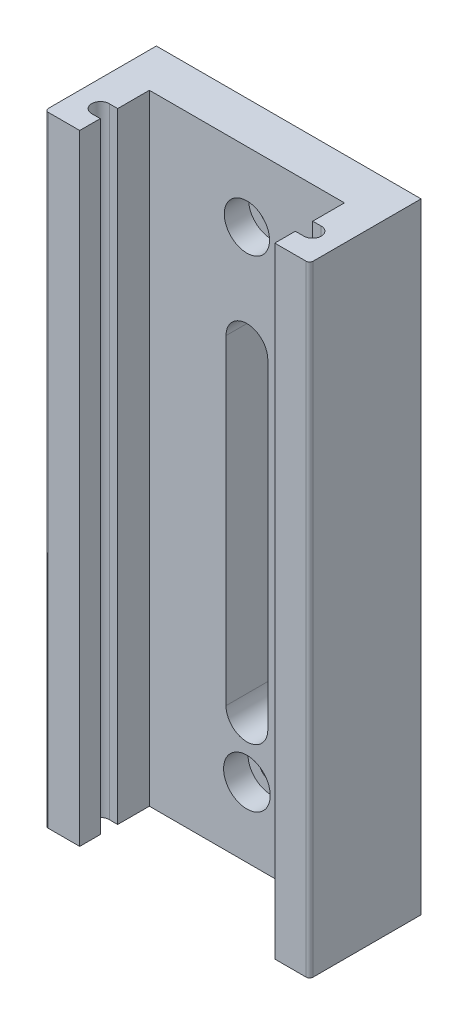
from build123d import *

# Parameters (mm, degrees)
EXTRUSION1_DEPTH        = 89
ESQUISSE2_R             = 3.25
ESQUISSE2_R_2           = 3.35
ENL_V_MAT_EXTRU_1_DEPTH = 3.5
ESQUISSE3_R             = 1.75
ENL_V_MAT_EXTRU_2_DEPTH = 98.710030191
ENL_V_MAT_EXTRU_3_DEPTH = 98.28823156
CONG_1_R                = 0.5


with BuildPart() as part:
    # Esquisse1 → Extrusion1 (new body)
    with BuildSketch(Plane(origin=(0, 0, 0), x_dir=(1, 0, 0), z_dir=(0, 1, 0))):
        with BuildLine():
            Line((0, 0), (0, 16))
            Line((0, 16), (38, 16))
            Line((38, 16), (38, 0))
            Line((38, 0), (33, 0))
            Line((33, 0), (33, 2.950300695))
            Line((33, 2.950300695), (34.2, 2.950300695))
            ThreePointArc((34.2, 2.950300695), (35.477416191, 4.2), (34.2, 5.449699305))
            Line((34.2, 5.449699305), (33, 5.449699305))
            Line((33, 5.449699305), (33, 10))
            Line((33, 10), (5, 10))
            Line((5, 10), (5, 5.449699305))
            Line((5, 5.449699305), (3.8, 5.449699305))
            ThreePointArc((3.8, 5.449699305), (2.522583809, 4.2), (3.8, 2.950300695))
            Line((3.8, 2.950300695), (5, 2.950300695))
            Line((5, 2.950300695), (5, 0))
            Line((5, 0), (0, 0))
        make_face()
    extrude(amount=EXTRUSION1_DEPTH)

    # Esquisse2 → Enl_v. mat.-Extru.1 (cut)
    with BuildSketch(Plane.XY.offset(-10)):
        with Locations((19, 79)):
            Circle(ESQUISSE2_R)
        with Locations((19, 10)):
            Circle(ESQUISSE2_R_2)
    extrude(amount=-ENL_V_MAT_EXTRU_1_DEPTH, mode=Mode.SUBTRACT)

    # Esquisse3 → Enl_v. mat.-Extru.2 (cut, through all)
    with BuildSketch(Plane.XY.offset(-13.5)):
        with Locations((19, 79)):
            Circle(ESQUISSE3_R)
        with Locations((19, 10)):
            Circle(ESQUISSE3_R)
    extrude(amount=-ENL_V_MAT_EXTRU_2_DEPTH, mode=Mode.SUBTRACT)

    # Esquisse4 → Enl_v. mat.-Extru.3 (cut, through all)
    with BuildSketch(Plane.XY.offset(-10)):
        with BuildLine():
            Line((22, 64), (22, 18))
            ThreePointArc((22, 18), (19, 15), (16, 18))
            Line((16, 18), (16, 64))
            ThreePointArc((16, 64), (19, 67), (22, 64))
        make_face()
    extrude(amount=-ENL_V_MAT_EXTRU_3_DEPTH, mode=Mode.SUBTRACT)

    # Cong_1
    cong_1_edges = [part.edges().sort_by_distance(p)[0] for p in [
        (0, 44.5, 0),
        (38, 44.5, 0),
    ]]
    fillet(cong_1_edges, radius=CONG_1_R)


solid = part.part
